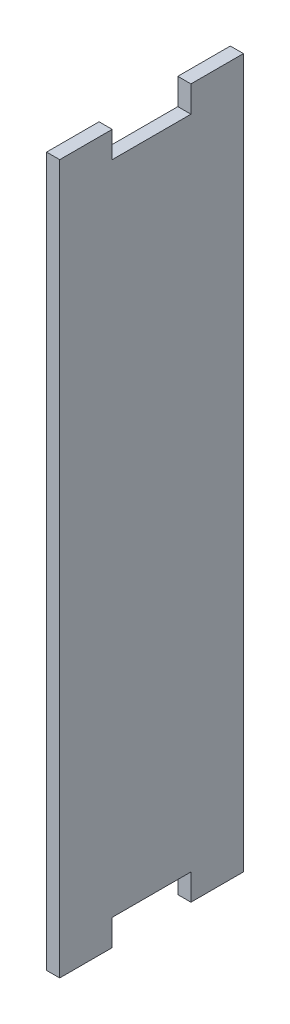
ISO-10303-21;
HEADER;
FILE_DESCRIPTION(('STEP AP214'),'2;1');
FILE_NAME('part.step','',(''),(''),'','','');
FILE_SCHEMA(('AUTOMOTIVE_DESIGN { 1 0 10303 214 1 1 1 1 }'));
ENDSEC;
DATA;
#1=APPLICATION_CONTEXT('core data for automotive mechanical design processes');
#2=APPLICATION_PROTOCOL_DEFINITION('international standard','automotive_design',2000,#1);
#3=PRODUCT_CONTEXT('',#1,'mechanical');
#4=PRODUCT('Part','Part','',(#3));
#5=PRODUCT_RELATED_PRODUCT_CATEGORY('part','',(#4));
#6=PRODUCT_DEFINITION_FORMATION('','',#4);
#7=PRODUCT_DEFINITION_CONTEXT('part definition',#1,'design');
#8=PRODUCT_DEFINITION('design','',#6,#7);
#9=PRODUCT_DEFINITION_SHAPE('','',#8);
#10=(LENGTH_UNIT() NAMED_UNIT(*) SI_UNIT(.MILLI.,.METRE.));
#11=(NAMED_UNIT(*) PLANE_ANGLE_UNIT() SI_UNIT($,.RADIAN.));
#12=(NAMED_UNIT(*) SI_UNIT($,.STERADIAN.) SOLID_ANGLE_UNIT());
#13=UNCERTAINTY_MEASURE_WITH_UNIT(LENGTH_MEASURE(1.E-05),#10,'distance_accuracy_value','');
#14=(GEOMETRIC_REPRESENTATION_CONTEXT(3) GLOBAL_UNCERTAINTY_ASSIGNED_CONTEXT((#13)) GLOBAL_UNIT_ASSIGNED_CONTEXT((#10,
#11,#12)) REPRESENTATION_CONTEXT('',''));
#15=CARTESIAN_POINT('',(0.,0.,0.));
#16=DIRECTION('',(0.,0.,1.));
#17=DIRECTION('',(1.,0.,0.));
#18=AXIS2_PLACEMENT_3D('',#15,#16,#17);
#19=CARTESIAN_POINT('',(3.175,0.,9.525));
#20=DIRECTION('',(0.,0.,1.));
#21=DIRECTION('',(0.,-1.,0.));
#22=AXIS2_PLACEMENT_3D('',#19,#20,#21);
#23=PLANE('',#22);
#24=DIRECTION('',(0.,1.,0.));
#25=VECTOR('',#24,1.);
#26=CARTESIAN_POINT('',(0.,0.,9.525));
#27=LINE('',#26,#25);
#28=CARTESIAN_POINT('',(0.,-6.35,9.525));
#29=VERTEX_POINT('',#28);
#30=CARTESIAN_POINT('',(0.,0.,9.525));
#31=VERTEX_POINT('',#30);
#32=EDGE_CURVE('E151',#29,#31,#27,.T.);
#33=ORIENTED_EDGE('',*,*,#32,.T.);
#34=DIRECTION('',(-1.,0.,0.));
#35=VECTOR('',#34,1.);
#36=CARTESIAN_POINT('',(3.175,0.,9.525));
#37=LINE('',#36,#35);
#38=CARTESIAN_POINT('',(3.175,0.,9.525));
#39=VERTEX_POINT('',#38);
#40=EDGE_CURVE('E11',#39,#31,#37,.T.);
#41=ORIENTED_EDGE('',*,*,#40,.F.);
#42=DIRECTION('',(0.,1.,0.));
#43=VECTOR('',#42,1.);
#44=CARTESIAN_POINT('',(3.175,0.,9.525));
#45=LINE('',#44,#43);
#46=CARTESIAN_POINT('',(3.175,-6.35,9.525));
#47=VERTEX_POINT('',#46);
#48=EDGE_CURVE('E173',#47,#39,#45,.T.);
#49=ORIENTED_EDGE('',*,*,#48,.F.);
#50=DIRECTION('',(-1.,0.,0.));
#51=VECTOR('',#50,1.);
#52=CARTESIAN_POINT('',(3.175,-6.35,9.525));
#53=LINE('',#52,#51);
#54=EDGE_CURVE('E147',#47,#29,#53,.T.);
#55=ORIENTED_EDGE('',*,*,#54,.T.);
#56=EDGE_LOOP('',(#33,#41,#49,#55));
#57=FACE_BOUND('',#56,.T.);
#58=ADVANCED_FACE('F31',(#57),#23,.F.);
#59=CARTESIAN_POINT('',(3.175,0.,9.525));
#60=DIRECTION('',(0.,1.,0.));
#61=DIRECTION('',(0.,0.,1.));
#62=AXIS2_PLACEMENT_3D('',#59,#60,#61);
#63=PLANE('',#62);
#64=DIRECTION('',(0.,0.,-1.));
#65=VECTOR('',#64,1.);
#66=CARTESIAN_POINT('',(0.,0.,9.525));
#67=LINE('',#66,#65);
#68=CARTESIAN_POINT('',(0.,0.,-9.525));
#69=VERTEX_POINT('',#68);
#70=EDGE_CURVE('E154',#31,#69,#67,.T.);
#71=ORIENTED_EDGE('',*,*,#70,.T.);
#72=DIRECTION('',(-1.,0.,0.));
#73=VECTOR('',#72,1.);
#74=CARTESIAN_POINT('',(3.175,0.,-9.525));
#75=LINE('',#74,#73);
#76=CARTESIAN_POINT('',(3.175,0.,-9.525));
#77=VERTEX_POINT('',#76);
#78=EDGE_CURVE('E39',#77,#69,#75,.T.);
#79=ORIENTED_EDGE('',*,*,#78,.F.);
#80=DIRECTION('',(0.,0.,-1.));
#81=VECTOR('',#80,1.);
#82=CARTESIAN_POINT('',(3.175,0.,9.525));
#83=LINE('',#82,#81);
#84=EDGE_CURVE('E102',#39,#77,#83,.T.);
#85=ORIENTED_EDGE('',*,*,#84,.F.);
#86=ORIENTED_EDGE('',*,*,#40,.T.);
#87=EDGE_LOOP('',(#71,#79,#85,#86));
#88=FACE_BOUND('',#87,.T.);
#89=ADVANCED_FACE('F251',(#88),#63,.F.);
#90=CARTESIAN_POINT('',(3.175,0.,-9.525));
#91=DIRECTION('',(0.,0.,-1.));
#92=DIRECTION('',(0.,1.,0.));
#93=AXIS2_PLACEMENT_3D('',#90,#91,#92);
#94=PLANE('',#93);
#95=DIRECTION('',(0.,-1.,0.));
#96=VECTOR('',#95,1.);
#97=CARTESIAN_POINT('',(0.,0.,-9.525));
#98=LINE('',#97,#96);
#99=CARTESIAN_POINT('',(0.,-6.35,-9.525));
#100=VERTEX_POINT('',#99);
#101=EDGE_CURVE('E156',#69,#100,#98,.T.);
#102=ORIENTED_EDGE('',*,*,#101,.T.);
#103=DIRECTION('',(-1.,0.,0.));
#104=VECTOR('',#103,1.);
#105=CARTESIAN_POINT('',(3.175,-6.35,-9.525));
#106=LINE('',#105,#104);
#107=CARTESIAN_POINT('',(3.175,-6.35,-9.525));
#108=VERTEX_POINT('',#107);
#109=EDGE_CURVE('E192',#108,#100,#106,.T.);
#110=ORIENTED_EDGE('',*,*,#109,.F.);
#111=DIRECTION('',(0.,-1.,0.));
#112=VECTOR('',#111,1.);
#113=CARTESIAN_POINT('',(3.175,0.,-9.525));
#114=LINE('',#113,#112);
#115=EDGE_CURVE('E200',#77,#108,#114,.T.);
#116=ORIENTED_EDGE('',*,*,#115,.F.);
#117=ORIENTED_EDGE('',*,*,#78,.T.);
#118=EDGE_LOOP('',(#102,#110,#116,#117));
#119=FACE_BOUND('',#118,.T.);
#120=ADVANCED_FACE('F198',(#119),#94,.F.);
#121=CARTESIAN_POINT('',(3.175,-6.35,-9.525));
#122=DIRECTION('',(0.,1.,0.));
#123=DIRECTION('',(0.,0.,1.));
#124=AXIS2_PLACEMENT_3D('',#121,#122,#123);
#125=PLANE('',#124);
#126=DIRECTION('',(0.,0.,-1.));
#127=VECTOR('',#126,1.);
#128=CARTESIAN_POINT('',(0.,-6.35,-9.525));
#129=LINE('',#128,#127);
#130=CARTESIAN_POINT('',(0.,-6.35,-22.225));
#131=VERTEX_POINT('',#130);
#132=EDGE_CURVE('E158',#100,#131,#129,.T.);
#133=ORIENTED_EDGE('',*,*,#132,.T.);
#134=DIRECTION('',(-1.,0.,0.));
#135=VECTOR('',#134,1.);
#136=CARTESIAN_POINT('',(3.175,-6.35,-22.225));
#137=LINE('',#136,#135);
#138=CARTESIAN_POINT('',(3.175,-6.35,-22.225));
#139=VERTEX_POINT('',#138);
#140=EDGE_CURVE('E189',#139,#131,#137,.T.);
#141=ORIENTED_EDGE('',*,*,#140,.F.);
#142=DIRECTION('',(0.,0.,-1.));
#143=VECTOR('',#142,1.);
#144=CARTESIAN_POINT('',(3.175,-6.35,-9.525));
#145=LINE('',#144,#143);
#146=EDGE_CURVE('E218',#108,#139,#145,.T.);
#147=ORIENTED_EDGE('',*,*,#146,.F.);
#148=ORIENTED_EDGE('',*,*,#109,.T.);
#149=EDGE_LOOP('',(#133,#141,#147,#148));
#150=FACE_BOUND('',#149,.T.);
#151=ADVANCED_FACE('F209',(#150),#125,.F.);
#152=CARTESIAN_POINT('',(3.175,-6.35,-22.225));
#153=DIRECTION('',(0.,0.,1.));
#154=DIRECTION('',(1.,0.,0.));
#155=AXIS2_PLACEMENT_3D('',#152,#153,#154);
#156=PLANE('',#155);
#157=DIRECTION('',(0.,1.,0.));
#158=VECTOR('',#157,1.);
#159=CARTESIAN_POINT('',(0.,-6.35,-22.225));
#160=LINE('',#159,#158);
#161=CARTESIAN_POINT('',(0.,165.1,-22.225));
#162=VERTEX_POINT('',#161);
#163=EDGE_CURVE('E160',#131,#162,#160,.T.);
#164=ORIENTED_EDGE('',*,*,#163,.T.);
#165=DIRECTION('',(-1.,0.,0.));
#166=VECTOR('',#165,1.);
#167=CARTESIAN_POINT('',(3.175,165.1,-22.225));
#168=LINE('',#167,#166);
#169=CARTESIAN_POINT('',(3.175,165.1,-22.225));
#170=VERTEX_POINT('',#169);
#171=EDGE_CURVE('E186',#170,#162,#168,.T.);
#172=ORIENTED_EDGE('',*,*,#171,.F.);
#173=DIRECTION('',(0.,1.,0.));
#174=VECTOR('',#173,1.);
#175=CARTESIAN_POINT('',(3.175,-6.35,-22.225));
#176=LINE('',#175,#174);
#177=EDGE_CURVE('E215',#139,#170,#176,.T.);
#178=ORIENTED_EDGE('',*,*,#177,.F.);
#179=ORIENTED_EDGE('',*,*,#140,.T.);
#180=EDGE_LOOP('',(#164,#172,#178,#179));
#181=FACE_BOUND('',#180,.T.);
#182=ADVANCED_FACE('F213',(#181),#156,.F.);
#183=CARTESIAN_POINT('',(3.175,165.1,-22.225));
#184=DIRECTION('',(0.,-1.,0.));
#185=DIRECTION('',(0.,0.,-1.));
#186=AXIS2_PLACEMENT_3D('',#183,#184,#185);
#187=PLANE('',#186);
#188=DIRECTION('',(0.,0.,1.));
#189=VECTOR('',#188,1.);
#190=CARTESIAN_POINT('',(0.,165.1,-22.225));
#191=LINE('',#190,#189);
#192=CARTESIAN_POINT('',(0.,165.1,-9.52500000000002));
#193=VERTEX_POINT('',#192);
#194=EDGE_CURVE('E162',#162,#193,#191,.T.);
#195=ORIENTED_EDGE('',*,*,#194,.T.);
#196=DIRECTION('',(-1.,0.,0.));
#197=VECTOR('',#196,1.);
#198=CARTESIAN_POINT('',(3.175,165.1,-9.52500000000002));
#199=LINE('',#198,#197);
#200=CARTESIAN_POINT('',(3.175,165.1,-9.52500000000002));
#201=VERTEX_POINT('',#200);
#202=EDGE_CURVE('E183',#201,#193,#199,.T.);
#203=ORIENTED_EDGE('',*,*,#202,.F.);
#204=DIRECTION('',(0.,0.,1.));
#205=VECTOR('',#204,1.);
#206=CARTESIAN_POINT('',(3.175,165.1,-22.225));
#207=LINE('',#206,#205);
#208=EDGE_CURVE('E217',#170,#201,#207,.T.);
#209=ORIENTED_EDGE('',*,*,#208,.F.);
#210=ORIENTED_EDGE('',*,*,#171,.T.);
#211=EDGE_LOOP('',(#195,#203,#209,#210));
#212=FACE_BOUND('',#211,.T.);
#213=ADVANCED_FACE('F264',(#212),#187,.F.);
#214=CARTESIAN_POINT('',(3.175,165.1,-9.52500000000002));
#215=DIRECTION('',(0.,0.,-1.));
#216=DIRECTION('',(-1.,0.,0.));
#217=AXIS2_PLACEMENT_3D('',#214,#215,#216);
#218=PLANE('',#217);
#219=DIRECTION('',(0.,-1.,0.));
#220=VECTOR('',#219,1.);
#221=CARTESIAN_POINT('',(0.,165.1,-9.52500000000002));
#222=LINE('',#221,#220);
#223=CARTESIAN_POINT('',(0.,158.75,-9.52500000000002));
#224=VERTEX_POINT('',#223);
#225=EDGE_CURVE('E164',#193,#224,#222,.T.);
#226=ORIENTED_EDGE('',*,*,#225,.T.);
#227=DIRECTION('',(-1.,0.,0.));
#228=VECTOR('',#227,1.);
#229=CARTESIAN_POINT('',(3.175,158.75,-9.52500000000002));
#230=LINE('',#229,#228);
#231=CARTESIAN_POINT('',(3.175,158.75,-9.52500000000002));
#232=VERTEX_POINT('',#231);
#233=EDGE_CURVE('E180',#232,#224,#230,.T.);
#234=ORIENTED_EDGE('',*,*,#233,.F.);
#235=DIRECTION('',(0.,-1.,0.));
#236=VECTOR('',#235,1.);
#237=CARTESIAN_POINT('',(3.175,165.1,-9.52500000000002));
#238=LINE('',#237,#236);
#239=EDGE_CURVE('E220',#201,#232,#238,.T.);
#240=ORIENTED_EDGE('',*,*,#239,.F.);
#241=ORIENTED_EDGE('',*,*,#202,.T.);
#242=EDGE_LOOP('',(#226,#234,#240,#241));
#243=FACE_BOUND('',#242,.T.);
#244=ADVANCED_FACE('F267',(#243),#218,.F.);
#245=CARTESIAN_POINT('',(3.175,158.75,9.52500000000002));
#246=DIRECTION('',(0.,-1.,0.));
#247=DIRECTION('',(0.,0.,-1.));
#248=AXIS2_PLACEMENT_3D('',#245,#246,#247);
#249=PLANE('',#248);
#250=DIRECTION('',(0.,0.,1.));
#251=VECTOR('',#250,1.);
#252=CARTESIAN_POINT('',(0.,158.75,9.52500000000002));
#253=LINE('',#252,#251);
#254=CARTESIAN_POINT('',(0.,158.75,9.52500000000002));
#255=VERTEX_POINT('',#254);
#256=EDGE_CURVE('E166',#224,#255,#253,.T.);
#257=ORIENTED_EDGE('',*,*,#256,.T.);
#258=DIRECTION('',(-1.,0.,0.));
#259=VECTOR('',#258,1.);
#260=CARTESIAN_POINT('',(3.175,158.75,9.52500000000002));
#261=LINE('',#260,#259);
#262=CARTESIAN_POINT('',(3.175,158.75,9.52500000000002));
#263=VERTEX_POINT('',#262);
#264=EDGE_CURVE('E177',#263,#255,#261,.T.);
#265=ORIENTED_EDGE('',*,*,#264,.F.);
#266=DIRECTION('',(0.,0.,1.));
#267=VECTOR('',#266,1.);
#268=CARTESIAN_POINT('',(3.175,158.75,9.52500000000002));
#269=LINE('',#268,#267);
#270=EDGE_CURVE('E226',#232,#263,#269,.T.);
#271=ORIENTED_EDGE('',*,*,#270,.F.);
#272=ORIENTED_EDGE('',*,*,#233,.T.);
#273=EDGE_LOOP('',(#257,#265,#271,#272));
#274=FACE_BOUND('',#273,.T.);
#275=ADVANCED_FACE('F232',(#274),#249,.F.);
#276=CARTESIAN_POINT('',(3.175,165.1,9.52500000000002));
#277=DIRECTION('',(0.,0.,1.));
#278=DIRECTION('',(1.,0.,0.));
#279=AXIS2_PLACEMENT_3D('',#276,#277,#278);
#280=PLANE('',#279);
#281=DIRECTION('',(0.,1.,0.));
#282=VECTOR('',#281,1.);
#283=CARTESIAN_POINT('',(0.,165.1,9.52500000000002));
#284=LINE('',#283,#282);
#285=CARTESIAN_POINT('',(0.,165.1,9.52500000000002));
#286=VERTEX_POINT('',#285);
#287=EDGE_CURVE('E168',#255,#286,#284,.T.);
#288=ORIENTED_EDGE('',*,*,#287,.T.);
#289=DIRECTION('',(-1.,0.,0.));
#290=VECTOR('',#289,1.);
#291=CARTESIAN_POINT('',(3.175,165.1,9.52500000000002));
#292=LINE('',#291,#290);
#293=CARTESIAN_POINT('',(3.175,165.1,9.52500000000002));
#294=VERTEX_POINT('',#293);
#295=EDGE_CURVE('E142',#294,#286,#292,.T.);
#296=ORIENTED_EDGE('',*,*,#295,.F.);
#297=DIRECTION('',(0.,1.,0.));
#298=VECTOR('',#297,1.);
#299=CARTESIAN_POINT('',(3.175,165.1,9.52500000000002));
#300=LINE('',#299,#298);
#301=EDGE_CURVE('E133',#263,#294,#300,.T.);
#302=ORIENTED_EDGE('',*,*,#301,.F.);
#303=ORIENTED_EDGE('',*,*,#264,.T.);
#304=EDGE_LOOP('',(#288,#296,#302,#303));
#305=FACE_BOUND('',#304,.T.);
#306=ADVANCED_FACE('F236',(#305),#280,.F.);
#307=CARTESIAN_POINT('',(3.175,165.1,22.225));
#308=DIRECTION('',(0.,-1.,0.));
#309=DIRECTION('',(0.,0.,-1.));
#310=AXIS2_PLACEMENT_3D('',#307,#308,#309);
#311=PLANE('',#310);
#312=DIRECTION('',(0.,0.,1.));
#313=VECTOR('',#312,1.);
#314=CARTESIAN_POINT('',(0.,165.1,22.225));
#315=LINE('',#314,#313);
#316=CARTESIAN_POINT('',(0.,165.1,22.225));
#317=VERTEX_POINT('',#316);
#318=EDGE_CURVE('E141',#286,#317,#315,.T.);
#319=ORIENTED_EDGE('',*,*,#318,.T.);
#320=DIRECTION('',(-1.,0.,0.));
#321=VECTOR('',#320,1.);
#322=CARTESIAN_POINT('',(3.175,165.1,22.225));
#323=LINE('',#322,#321);
#324=CARTESIAN_POINT('',(3.175,165.1,22.225));
#325=VERTEX_POINT('',#324);
#326=EDGE_CURVE('E138',#325,#317,#323,.T.);
#327=ORIENTED_EDGE('',*,*,#326,.F.);
#328=DIRECTION('',(0.,0.,1.));
#329=VECTOR('',#328,1.);
#330=CARTESIAN_POINT('',(3.175,165.1,22.225));
#331=LINE('',#330,#329);
#332=EDGE_CURVE('E127',#294,#325,#331,.T.);
#333=ORIENTED_EDGE('',*,*,#332,.F.);
#334=ORIENTED_EDGE('',*,*,#295,.T.);
#335=EDGE_LOOP('',(#319,#327,#333,#334));
#336=FACE_BOUND('',#335,.T.);
#337=ADVANCED_FACE('F139',(#336),#311,.F.);
#338=CARTESIAN_POINT('',(3.175,-6.35,22.225));
#339=DIRECTION('',(0.,0.,-1.));
#340=DIRECTION('',(-1.,0.,0.));
#341=AXIS2_PLACEMENT_3D('',#338,#339,#340);
#342=PLANE('',#341);
#343=DIRECTION('',(0.,-1.,0.));
#344=VECTOR('',#343,1.);
#345=CARTESIAN_POINT('',(0.,-6.35,22.225));
#346=LINE('',#345,#344);
#347=CARTESIAN_POINT('',(0.,-6.35,22.225));
#348=VERTEX_POINT('',#347);
#349=EDGE_CURVE('E88',#317,#348,#346,.T.);
#350=ORIENTED_EDGE('',*,*,#349,.T.);
#351=DIRECTION('',(-1.,0.,0.));
#352=VECTOR('',#351,1.);
#353=CARTESIAN_POINT('',(3.175,-6.35,22.225));
#354=LINE('',#353,#352);
#355=CARTESIAN_POINT('',(3.175,-6.35,22.225));
#356=VERTEX_POINT('',#355);
#357=EDGE_CURVE('E143',#356,#348,#354,.T.);
#358=ORIENTED_EDGE('',*,*,#357,.F.);
#359=DIRECTION('',(0.,-1.,0.));
#360=VECTOR('',#359,1.);
#361=CARTESIAN_POINT('',(3.175,-6.35,22.225));
#362=LINE('',#361,#360);
#363=EDGE_CURVE('E131',#325,#356,#362,.T.);
#364=ORIENTED_EDGE('',*,*,#363,.F.);
#365=ORIENTED_EDGE('',*,*,#326,.T.);
#366=EDGE_LOOP('',(#350,#358,#364,#365));
#367=FACE_BOUND('',#366,.T.);
#368=ADVANCED_FACE('F145',(#367),#342,.F.);
#369=CARTESIAN_POINT('',(3.175,-6.35,9.525));
#370=DIRECTION('',(0.,1.,0.));
#371=DIRECTION('',(0.,0.,1.));
#372=AXIS2_PLACEMENT_3D('',#369,#370,#371);
#373=PLANE('',#372);
#374=DIRECTION('',(0.,0.,-1.));
#375=VECTOR('',#374,1.);
#376=CARTESIAN_POINT('',(0.,-6.35,9.525));
#377=LINE('',#376,#375);
#378=EDGE_CURVE('E94',#348,#29,#377,.T.);
#379=ORIENTED_EDGE('',*,*,#378,.T.);
#380=ORIENTED_EDGE('',*,*,#54,.F.);
#381=DIRECTION('',(0.,0.,-1.));
#382=VECTOR('',#381,1.);
#383=CARTESIAN_POINT('',(3.175,-6.35,9.525));
#384=LINE('',#383,#382);
#385=EDGE_CURVE('E47',#356,#47,#384,.T.);
#386=ORIENTED_EDGE('',*,*,#385,.F.);
#387=ORIENTED_EDGE('',*,*,#357,.T.);
#388=EDGE_LOOP('',(#379,#380,#386,#387));
#389=FACE_BOUND('',#388,.T.);
#390=ADVANCED_FACE('F240',(#389),#373,.F.);
#391=CARTESIAN_POINT('',(3.175,-6.35,9.525));
#392=DIRECTION('',(-1.,0.,0.));
#393=DIRECTION('',(0.,0.,1.));
#394=AXIS2_PLACEMENT_3D('',#391,#392,#393);
#395=PLANE('',#394);
#396=ORIENTED_EDGE('',*,*,#48,.T.);
#397=ORIENTED_EDGE('',*,*,#84,.T.);
#398=ORIENTED_EDGE('',*,*,#115,.T.);
#399=ORIENTED_EDGE('',*,*,#146,.T.);
#400=ORIENTED_EDGE('',*,*,#177,.T.);
#401=ORIENTED_EDGE('',*,*,#208,.T.);
#402=ORIENTED_EDGE('',*,*,#239,.T.);
#403=ORIENTED_EDGE('',*,*,#270,.T.);
#404=ORIENTED_EDGE('',*,*,#301,.T.);
#405=ORIENTED_EDGE('',*,*,#332,.T.);
#406=ORIENTED_EDGE('',*,*,#363,.T.);
#407=ORIENTED_EDGE('',*,*,#385,.T.);
#408=EDGE_LOOP('',(#396,#397,#398,#399,#400,#401,#402,#403,#404,#405,#406,#407));
#409=FACE_BOUND('',#408,.T.);
#410=ADVANCED_FACE('F129',(#409),#395,.F.);
#411=CARTESIAN_POINT('',(0.,-6.35,9.525));
#412=DIRECTION('',(-1.,0.,0.));
#413=DIRECTION('',(0.,0.,1.));
#414=AXIS2_PLACEMENT_3D('',#411,#412,#413);
#415=PLANE('',#414);
#416=ORIENTED_EDGE('',*,*,#32,.F.);
#417=ORIENTED_EDGE('',*,*,#378,.F.);
#418=ORIENTED_EDGE('',*,*,#349,.F.);
#419=ORIENTED_EDGE('',*,*,#318,.F.);
#420=ORIENTED_EDGE('',*,*,#287,.F.);
#421=ORIENTED_EDGE('',*,*,#256,.F.);
#422=ORIENTED_EDGE('',*,*,#225,.F.);
#423=ORIENTED_EDGE('',*,*,#194,.F.);
#424=ORIENTED_EDGE('',*,*,#163,.F.);
#425=ORIENTED_EDGE('',*,*,#132,.F.);
#426=ORIENTED_EDGE('',*,*,#101,.F.);
#427=ORIENTED_EDGE('',*,*,#70,.F.);
#428=EDGE_LOOP('',(#416,#417,#418,#419,#420,#421,#422,#423,#424,#425,#426,#427));
#429=FACE_BOUND('',#428,.T.);
#430=ADVANCED_FACE('F204',(#429),#415,.T.);
#431=CLOSED_SHELL('',(#58,#89,#120,#151,#182,#213,#244,#275,#306,#337,#368,#390,#410,#430));
#432=MANIFOLD_SOLID_BREP('B2',#431);
#433=ADVANCED_BREP_SHAPE_REPRESENTATION('',(#18,#432),#14);
#434=SHAPE_DEFINITION_REPRESENTATION(#9,#433);
ENDSEC;
END-ISO-10303-21;
